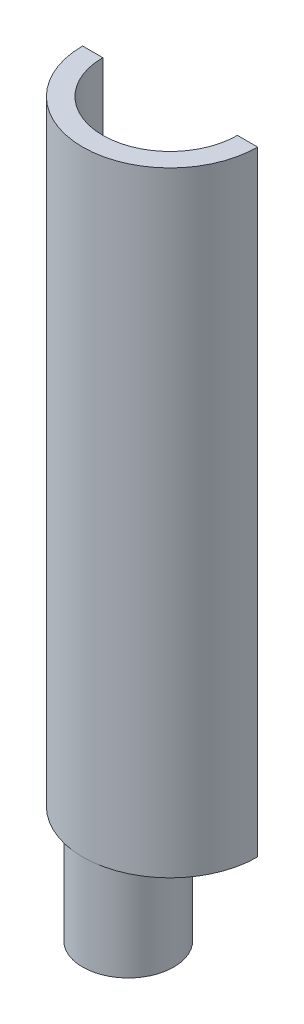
from build123d import *

# Parameters (mm, degrees)
BOSS_EXTRUDE1_DEPTH     = 58
BOSS_EXTRUDE2_DEPTH     = 1.4
SKETCH4_R               = 3
BOSS_EXTRUDE3_DEPTH     = 9
SKETCH5_R               = 1
CUT_EXTRUDE1_DEPTH      = 9
CUT_EXTRUDE2_DEPTH      = 10
CUT_EXTRUDE2_DEPTH_BACK = 60.16324915
SKETCH6_W               = 1.663700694
SKETCH6_H               = 3.4


with BuildPart() as part:
    # Sketch1 → Boss-Extrude1 (new body)
    with BuildSketch(Plane(origin=(0, 0, 0), x_dir=(-1, 0, 0), z_dir=(0, 1, 0))):
        with BuildLine():
            Line((-8.255, 0), (-6.35, 0))
            ThreePointArc((-6.35, 0), (0, 6.35), (6.35, 0))
            Line((6.35, 0), (8.255, 0))
            ThreePointArc((8.255, 0), (0, 8.255), (-8.255, 0))
        make_face()
    extrude(amount=BOSS_EXTRUDE1_DEPTH)

    # Sketch2 → Boss-Extrude2 (add)
    with BuildSketch(Plane(origin=(0, 0, 0), x_dir=(-1, 0, 0), z_dir=(0, 1, 0))):
        with BuildLine():
            Line((-8.255, 0), (8.255, 0))
            ThreePointArc((8.255, 0), (0, 8.255), (-8.255, 0))
        make_face()
    extrude(amount=BOSS_EXTRUDE2_DEPTH)

    # Sketch4 → Boss-Extrude3 (add)
    with BuildSketch(Plane(origin=(0, 0, 0), x_dir=(-1, 0, 0), z_dir=(0, 1, 0))):
        with BuildLine():
            Line((0, 0), (-1.687594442, 0))
            ThreePointArc((-1.687594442, 0), (0, 8.255), (1.687594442, 0))
            Line((1.687594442, 0), (0, 0))
        make_face()
        with Locations(Location((0, 3.955, 0), (0, 0, 90))):
            Circle(SKETCH4_R, mode=Mode.SUBTRACT)
    extrude(amount=-BOSS_EXTRUDE3_DEPTH)

    # Sketch5 → Cut-Extrude1 (cut)
    with BuildSketch(Plane(origin=(0, 0, 0), x_dir=(-1, 0, 0), z_dir=(0, 1, 0))):
        with Locations(Location((0, 3.955, 0), (0, 0, 90))):
            Circle(SKETCH5_R)
    extrude(amount=CUT_EXTRUDE1_DEPTH, mode=Mode.SUBTRACT)

    # Sketch6 → Cut-Extrude2 (cut, two sides: drawn at the far end of the back side and taken through both)
    with BuildSketch(Plane(origin=(0, 0, 0), x_dir=(-1, 0, 0), z_dir=(0, 1, 0)).offset(-CUT_EXTRUDE2_DEPTH_BACK)):
        with Locations((0, 1.7)):
            Rectangle(SKETCH6_W, SKETCH6_H)
    extrude(amount=CUT_EXTRUDE2_DEPTH + CUT_EXTRUDE2_DEPTH_BACK, mode=Mode.SUBTRACT)


solid = part.part
